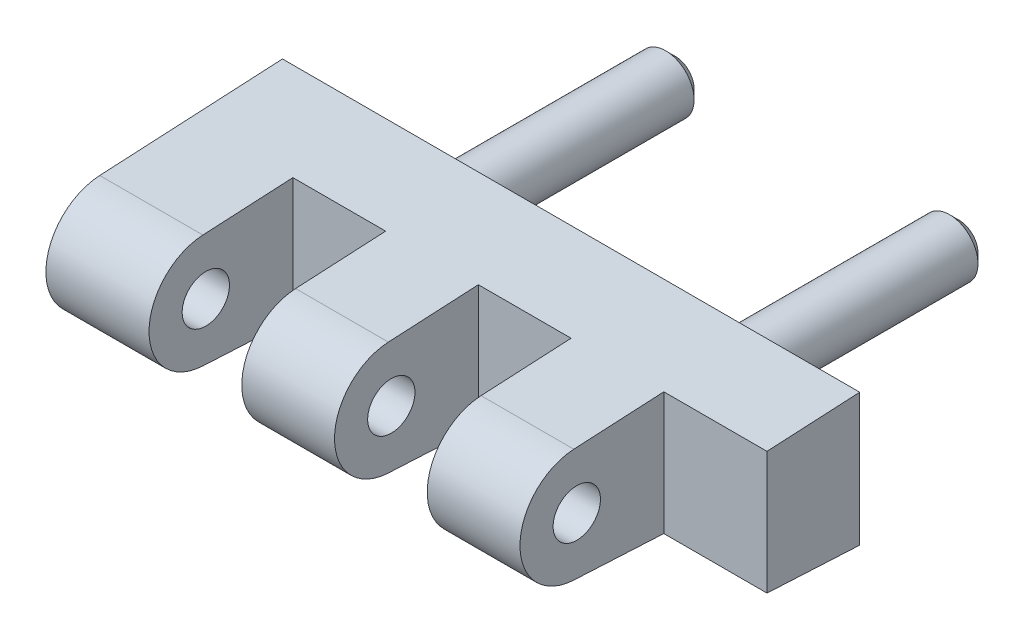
ISO-10303-21;
HEADER;
FILE_DESCRIPTION(('STEP AP214'),'2;1');
FILE_NAME('part.step','',(''),(''),'','','');
FILE_SCHEMA(('AUTOMOTIVE_DESIGN { 1 0 10303 214 1 1 1 1 }'));
ENDSEC;
DATA;
#1=APPLICATION_CONTEXT('core data for automotive mechanical design processes');
#2=APPLICATION_PROTOCOL_DEFINITION('international standard','automotive_design',2000,#1);
#3=PRODUCT_CONTEXT('',#1,'mechanical');
#4=PRODUCT('Part','Part','',(#3));
#5=PRODUCT_RELATED_PRODUCT_CATEGORY('part','',(#4));
#6=PRODUCT_DEFINITION_FORMATION('','',#4);
#7=PRODUCT_DEFINITION_CONTEXT('part definition',#1,'design');
#8=PRODUCT_DEFINITION('design','',#6,#7);
#9=PRODUCT_DEFINITION_SHAPE('','',#8);
#10=(LENGTH_UNIT() NAMED_UNIT(*) SI_UNIT(.MILLI.,.METRE.));
#11=(NAMED_UNIT(*) PLANE_ANGLE_UNIT() SI_UNIT($,.RADIAN.));
#12=(NAMED_UNIT(*) SI_UNIT($,.STERADIAN.) SOLID_ANGLE_UNIT());
#13=UNCERTAINTY_MEASURE_WITH_UNIT(LENGTH_MEASURE(1.E-05),#10,'distance_accuracy_value','');
#14=(GEOMETRIC_REPRESENTATION_CONTEXT(3) GLOBAL_UNCERTAINTY_ASSIGNED_CONTEXT((#13)) GLOBAL_UNIT_ASSIGNED_CONTEXT((#10,
#11,#12)) REPRESENTATION_CONTEXT('',''));
#15=CARTESIAN_POINT('',(0.,0.,0.));
#16=DIRECTION('',(0.,0.,1.));
#17=DIRECTION('',(1.,0.,0.));
#18=AXIS2_PLACEMENT_3D('',#15,#16,#17);
#19=CARTESIAN_POINT('',(22.75,0.,9.5));
#20=DIRECTION('',(-1.,0.,0.));
#21=DIRECTION('',(0.,-1.,0.));
#22=AXIS2_PLACEMENT_3D('',#19,#20,#21);
#23=CYLINDRICAL_SURFACE('',#22,3.);
#24=DIRECTION('',(-1.,0.,0.));
#25=VECTOR('',#24,1.);
#26=CARTESIAN_POINT('',(22.75,-2.99592082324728,9.65639188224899));
#27=LINE('',#26,#25);
#28=CARTESIAN_POINT('',(-2.3,-2.99592082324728,9.65639188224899));
#29=VERTEX_POINT('',#28);
#30=CARTESIAN_POINT('',(-7.75,-2.99592082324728,9.65639188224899));
#31=VERTEX_POINT('',#30);
#32=EDGE_CURVE('E157',#29,#31,#27,.T.);
#33=ORIENTED_EDGE('',*,*,#32,.F.);
#34=CARTESIAN_POINT('',(-2.3,0.,9.5));
#35=DIRECTION('',(-1.,0.,0.));
#36=DIRECTION('',(0.,0.,1.));
#37=AXIS2_PLACEMENT_3D('',#34,#35,#36);
#38=CIRCLE('',#37,3.);
#39=CARTESIAN_POINT('',(-2.3,2.99592082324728,9.65639188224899));
#40=VERTEX_POINT('',#39);
#41=EDGE_CURVE('E200',#29,#40,#38,.T.);
#42=ORIENTED_EDGE('',*,*,#41,.T.);
#43=DIRECTION('',(-1.,0.,0.));
#44=VECTOR('',#43,1.);
#45=CARTESIAN_POINT('',(22.75,2.99592082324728,9.65639188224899));
#46=LINE('',#45,#44);
#47=CARTESIAN_POINT('',(-7.75,2.99592082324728,9.65639188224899));
#48=VERTEX_POINT('',#47);
#49=EDGE_CURVE('E170',#40,#48,#46,.T.);
#50=ORIENTED_EDGE('',*,*,#49,.T.);
#51=CARTESIAN_POINT('',(-7.75,0.,9.5));
#52=DIRECTION('',(1.,0.,0.));
#53=DIRECTION('',(0.,1.,0.));
#54=AXIS2_PLACEMENT_3D('',#51,#52,#53);
#55=CIRCLE('',#54,3.);
#56=EDGE_CURVE('E152',#48,#31,#55,.T.);
#57=ORIENTED_EDGE('',*,*,#56,.T.);
#58=EDGE_LOOP('',(#33,#42,#50,#57));
#59=FACE_BOUND('',#58,.T.);
#60=ADVANCED_FACE('F14',(#59),#23,.T.);
#61=CARTESIAN_POINT('',(7.5,2.99592082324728,9.65639188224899));
#62=VERTEX_POINT('',#61);
#63=CARTESIAN_POINT('',(2.6,2.99592082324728,9.65639188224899));
#64=VERTEX_POINT('',#63);
#65=EDGE_CURVE('E172',#62,#64,#46,.T.);
#66=ORIENTED_EDGE('',*,*,#65,.T.);
#67=CARTESIAN_POINT('',(2.6,0.,9.5));
#68=DIRECTION('',(1.,0.,0.));
#69=DIRECTION('',(0.,0.,-1.));
#70=AXIS2_PLACEMENT_3D('',#67,#68,#69);
#71=CIRCLE('',#70,3.);
#72=CARTESIAN_POINT('',(2.6,-2.99592082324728,9.65639188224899));
#73=VERTEX_POINT('',#72);
#74=EDGE_CURVE('E195',#64,#73,#71,.T.);
#75=ORIENTED_EDGE('',*,*,#74,.T.);
#76=CARTESIAN_POINT('',(7.5,-2.99592082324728,9.65639188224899));
#77=VERTEX_POINT('',#76);
#78=EDGE_CURVE('E168',#77,#73,#27,.T.);
#79=ORIENTED_EDGE('',*,*,#78,.F.);
#80=CARTESIAN_POINT('',(7.5,0.,9.5));
#81=DIRECTION('',(-1.,0.,0.));
#82=DIRECTION('',(0.,0.,1.));
#83=AXIS2_PLACEMENT_3D('',#80,#81,#82);
#84=CIRCLE('',#83,3.);
#85=EDGE_CURVE('E190',#77,#62,#84,.T.);
#86=ORIENTED_EDGE('',*,*,#85,.T.);
#87=EDGE_LOOP('',(#66,#75,#79,#86));
#88=FACE_BOUND('',#87,.T.);
#89=ADVANCED_FACE('F230',(#88),#23,.T.);
#90=CARTESIAN_POINT('',(22.75,0.,9.5));
#91=DIRECTION('',(-1.,0.,0.));
#92=DIRECTION('',(0.,-1.,0.));
#93=AXIS2_PLACEMENT_3D('',#90,#91,#92);
#94=CYLINDRICAL_SURFACE('',#93,1.25);
#95=CARTESIAN_POINT('',(-2.3,0.,9.5));
#96=DIRECTION('',(-1.,0.,0.));
#97=DIRECTION('',(0.,0.,1.));
#98=AXIS2_PLACEMENT_3D('',#95,#96,#97);
#99=CIRCLE('',#98,1.25);
#100=CARTESIAN_POINT('',(-2.3,0.,10.75));
#101=VERTEX_POINT('',#100);
#102=EDGE_CURVE('E197',#101,#101,#99,.T.);
#103=ORIENTED_EDGE('',*,*,#102,.F.);
#104=EDGE_LOOP('',(#103));
#105=FACE_BOUND('',#104,.T.);
#106=CARTESIAN_POINT('',(-7.75,0.,9.5));
#107=DIRECTION('',(1.,0.,0.));
#108=DIRECTION('',(0.,1.,0.));
#109=AXIS2_PLACEMENT_3D('',#106,#107,#108);
#110=CIRCLE('',#109,1.25);
#111=CARTESIAN_POINT('',(-7.75,1.25,9.5));
#112=VERTEX_POINT('',#111);
#113=EDGE_CURVE('E140',#112,#112,#110,.T.);
#114=ORIENTED_EDGE('',*,*,#113,.F.);
#115=EDGE_LOOP('',(#114));
#116=FACE_BOUND('',#115,.T.);
#117=ADVANCED_FACE('F238',(#105,#116),#94,.F.);
#118=CARTESIAN_POINT('',(22.75,0.,9.5));
#119=DIRECTION('',(1.,0.,0.));
#120=DIRECTION('',(0.,1.,0.));
#121=AXIS2_PLACEMENT_3D('',#118,#119,#120);
#122=PLANE('',#121);
#123=DIRECTION('',(0.,1.,0.));
#124=VECTOR('',#123,1.);
#125=CARTESIAN_POINT('',(22.75,0.,4.9));
#126=LINE('',#125,#124);
#127=CARTESIAN_POINT('',(22.75,-3.24421212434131,4.9));
#128=VERTEX_POINT('',#127);
#129=CARTESIAN_POINT('',(22.75,3.24421212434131,4.9));
#130=VERTEX_POINT('',#129);
#131=EDGE_CURVE('E141',#128,#130,#126,.T.);
#132=ORIENTED_EDGE('',*,*,#131,.F.);
#133=DIRECTION('',(0.,-0.0521306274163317,-0.998640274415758));
#134=VECTOR('',#133,1.);
#135=CARTESIAN_POINT('',(22.75,-3.5,0.));
#136=LINE('',#135,#134);
#137=CARTESIAN_POINT('',(22.75,-3.5,0.));
#138=VERTEX_POINT('',#137);
#139=EDGE_CURVE('E139',#128,#138,#136,.T.);
#140=ORIENTED_EDGE('',*,*,#139,.T.);
#141=DIRECTION('',(0.,1.,0.));
#142=VECTOR('',#141,1.);
#143=CARTESIAN_POINT('',(22.75,-3.5,0.));
#144=LINE('',#143,#142);
#145=CARTESIAN_POINT('',(22.75,3.5,0.));
#146=VERTEX_POINT('',#145);
#147=EDGE_CURVE('E151',#138,#146,#144,.T.);
#148=ORIENTED_EDGE('',*,*,#147,.T.);
#149=DIRECTION('',(0.,-0.0521306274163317,0.998640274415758));
#150=VECTOR('',#149,1.);
#151=CARTESIAN_POINT('',(22.75,3.5,0.));
#152=LINE('',#151,#150);
#153=EDGE_CURVE('E154',#146,#130,#152,.T.);
#154=ORIENTED_EDGE('',*,*,#153,.T.);
#155=EDGE_LOOP('',(#132,#140,#148,#154));
#156=FACE_BOUND('',#155,.T.);
#157=ADVANCED_FACE('F339',(#156),#122,.T.);
#158=CARTESIAN_POINT('',(-7.75,0.,9.5));
#159=DIRECTION('',(1.,0.,0.));
#160=DIRECTION('',(0.,1.,0.));
#161=AXIS2_PLACEMENT_3D('',#158,#159,#160);
#162=PLANE('',#161);
#163=DIRECTION('',(0.,-0.0521306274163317,-0.998640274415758));
#164=VECTOR('',#163,1.);
#165=CARTESIAN_POINT('',(-7.75,-3.5,0.));
#166=LINE('',#165,#164);
#167=CARTESIAN_POINT('',(-7.75,-3.5,0.));
#168=VERTEX_POINT('',#167);
#169=EDGE_CURVE('E144',#31,#168,#166,.T.);
#170=ORIENTED_EDGE('',*,*,#169,.F.);
#171=ORIENTED_EDGE('',*,*,#56,.F.);
#172=DIRECTION('',(0.,-0.0521306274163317,0.998640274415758));
#173=VECTOR('',#172,1.);
#174=CARTESIAN_POINT('',(-7.75,3.5,0.));
#175=LINE('',#174,#173);
#176=CARTESIAN_POINT('',(-7.75,3.5,0.));
#177=VERTEX_POINT('',#176);
#178=EDGE_CURVE('E162',#177,#48,#175,.T.);
#179=ORIENTED_EDGE('',*,*,#178,.F.);
#180=DIRECTION('',(0.,1.,0.));
#181=VECTOR('',#180,1.);
#182=CARTESIAN_POINT('',(-7.75,-3.5,0.));
#183=LINE('',#182,#181);
#184=EDGE_CURVE('E160',#168,#177,#183,.T.);
#185=ORIENTED_EDGE('',*,*,#184,.F.);
#186=EDGE_LOOP('',(#170,#171,#179,#185));
#187=FACE_BOUND('',#186,.T.);
#188=ORIENTED_EDGE('',*,*,#113,.T.);
#189=EDGE_LOOP('',(#188));
#190=FACE_BOUND('',#189,.T.);
#191=ADVANCED_FACE('F341',(#187,#190),#162,.F.);
#192=CARTESIAN_POINT('',(22.75,-3.5,0.));
#193=DIRECTION('',(0.,0.998640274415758,-0.0521306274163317));
#194=DIRECTION('',(0.,0.0521306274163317,0.998640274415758));
#195=AXIS2_PLACEMENT_3D('',#192,#193,#194);
#196=PLANE('',#195);
#197=DIRECTION('',(-1.,0.,0.));
#198=VECTOR('',#197,1.);
#199=CARTESIAN_POINT('',(22.75,-3.24421212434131,4.9));
#200=LINE('',#199,#198);
#201=CARTESIAN_POINT('',(2.6,-3.24421212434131,4.9));
#202=VERTEX_POINT('',#201);
#203=CARTESIAN_POINT('',(-2.3,-3.24421212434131,4.9));
#204=VERTEX_POINT('',#203);
#205=EDGE_CURVE('E146',#202,#204,#200,.T.);
#206=ORIENTED_EDGE('',*,*,#205,.T.);
#207=DIRECTION('',(0.,0.0521306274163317,0.998640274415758));
#208=VECTOR('',#207,1.);
#209=CARTESIAN_POINT('',(-2.3,-3.5,0.));
#210=LINE('',#209,#208);
#211=EDGE_CURVE('E280',#204,#29,#210,.T.);
#212=ORIENTED_EDGE('',*,*,#211,.T.);
#213=ORIENTED_EDGE('',*,*,#32,.T.);
#214=ORIENTED_EDGE('',*,*,#169,.T.);
#215=DIRECTION('',(-1.,0.,0.));
#216=VECTOR('',#215,1.);
#217=CARTESIAN_POINT('',(22.75,-3.5,0.));
#218=LINE('',#217,#216);
#219=EDGE_CURVE('E177',#138,#168,#218,.T.);
#220=ORIENTED_EDGE('',*,*,#219,.F.);
#221=ORIENTED_EDGE('',*,*,#139,.F.);
#222=DIRECTION('',(-1.,0.,0.));
#223=VECTOR('',#222,1.);
#224=CARTESIAN_POINT('',(22.75,-3.24421212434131,4.9));
#225=LINE('',#224,#223);
#226=CARTESIAN_POINT('',(17.3,-3.24421212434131,4.9));
#227=VERTEX_POINT('',#226);
#228=EDGE_CURVE('E128',#128,#227,#225,.T.);
#229=ORIENTED_EDGE('',*,*,#228,.T.);
#230=DIRECTION('',(0.,0.0521306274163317,0.998640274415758));
#231=VECTOR('',#230,1.);
#232=CARTESIAN_POINT('',(17.3,-3.5,0.));
#233=LINE('',#232,#231);
#234=CARTESIAN_POINT('',(17.3,-2.99592082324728,9.65639188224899));
#235=VERTEX_POINT('',#234);
#236=EDGE_CURVE('E115',#227,#235,#233,.T.);
#237=ORIENTED_EDGE('',*,*,#236,.T.);
#238=CARTESIAN_POINT('',(12.4,-2.99592082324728,9.65639188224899));
#239=VERTEX_POINT('',#238);
#240=EDGE_CURVE('E169',#235,#239,#27,.T.);
#241=ORIENTED_EDGE('',*,*,#240,.T.);
#242=DIRECTION('',(0.,-0.0521306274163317,-0.998640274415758));
#243=VECTOR('',#242,1.);
#244=CARTESIAN_POINT('',(12.4,-3.5,0.));
#245=LINE('',#244,#243);
#246=CARTESIAN_POINT('',(12.4,-3.24421212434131,4.9));
#247=VERTEX_POINT('',#246);
#248=EDGE_CURVE('E191',#239,#247,#245,.T.);
#249=ORIENTED_EDGE('',*,*,#248,.T.);
#250=DIRECTION('',(-1.,0.,0.));
#251=VECTOR('',#250,1.);
#252=CARTESIAN_POINT('',(22.75,-3.24421212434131,4.9));
#253=LINE('',#252,#251);
#254=CARTESIAN_POINT('',(7.5,-3.24421212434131,4.9));
#255=VERTEX_POINT('',#254);
#256=EDGE_CURVE('E283',#247,#255,#253,.T.);
#257=ORIENTED_EDGE('',*,*,#256,.T.);
#258=DIRECTION('',(0.,0.0521306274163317,0.998640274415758));
#259=VECTOR('',#258,1.);
#260=CARTESIAN_POINT('',(7.5,-3.5,0.));
#261=LINE('',#260,#259);
#262=EDGE_CURVE('E196',#255,#77,#261,.T.);
#263=ORIENTED_EDGE('',*,*,#262,.T.);
#264=ORIENTED_EDGE('',*,*,#78,.T.);
#265=DIRECTION('',(0.,-0.0521306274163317,-0.998640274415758));
#266=VECTOR('',#265,1.);
#267=CARTESIAN_POINT('',(2.6,-3.5,0.));
#268=LINE('',#267,#266);
#269=EDGE_CURVE('E37',#73,#202,#268,.T.);
#270=ORIENTED_EDGE('',*,*,#269,.T.);
#271=EDGE_LOOP('',(#206,#212,#213,#214,#220,#221,#229,#237,#241,#249,#257,#263,#264,#270));
#272=FACE_BOUND('',#271,.T.);
#273=ADVANCED_FACE('F137',(#272),#196,.F.);
#274=CARTESIAN_POINT('',(22.75,-3.5,0.));
#275=DIRECTION('',(0.,0.,1.));
#276=DIRECTION('',(0.,-1.,0.));
#277=AXIS2_PLACEMENT_3D('',#274,#275,#276);
#278=PLANE('',#277);
#279=CARTESIAN_POINT('',(0.,0.,0.));
#280=DIRECTION('',(0.,0.,-1.));
#281=DIRECTION('',(-1.,0.,0.));
#282=AXIS2_PLACEMENT_3D('',#279,#280,#281);
#283=CIRCLE('',#282,1.5);
#284=CARTESIAN_POINT('',(-1.5,0.,0.));
#285=VERTEX_POINT('',#284);
#286=EDGE_CURVE('E133',#285,#285,#283,.T.);
#287=ORIENTED_EDGE('',*,*,#286,.F.);
#288=EDGE_LOOP('',(#287));
#289=FACE_BOUND('',#288,.T.);
#290=CARTESIAN_POINT('',(15.,0.,0.));
#291=DIRECTION('',(0.,0.,-1.));
#292=DIRECTION('',(-1.,0.,0.));
#293=AXIS2_PLACEMENT_3D('',#290,#291,#292);
#294=CIRCLE('',#293,1.5);
#295=CARTESIAN_POINT('',(13.5,0.,0.));
#296=VERTEX_POINT('',#295);
#297=EDGE_CURVE('E516',#296,#296,#294,.T.);
#298=ORIENTED_EDGE('',*,*,#297,.F.);
#299=EDGE_LOOP('',(#298));
#300=FACE_BOUND('',#299,.T.);
#301=ORIENTED_EDGE('',*,*,#184,.T.);
#302=DIRECTION('',(-1.,0.,0.));
#303=VECTOR('',#302,1.);
#304=CARTESIAN_POINT('',(22.75,3.5,0.));
#305=LINE('',#304,#303);
#306=EDGE_CURVE('E174',#146,#177,#305,.T.);
#307=ORIENTED_EDGE('',*,*,#306,.F.);
#308=ORIENTED_EDGE('',*,*,#147,.F.);
#309=ORIENTED_EDGE('',*,*,#219,.T.);
#310=EDGE_LOOP('',(#301,#307,#308,#309));
#311=FACE_BOUND('',#310,.T.);
#312=ADVANCED_FACE('F253',(#289,#300,#311),#278,.F.);
#313=CARTESIAN_POINT('',(22.75,3.5,0.));
#314=DIRECTION('',(0.,-0.998640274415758,-0.0521306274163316));
#315=DIRECTION('',(0.,0.0521306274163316,-0.998640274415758));
#316=AXIS2_PLACEMENT_3D('',#313,#314,#315);
#317=PLANE('',#316);
#318=ORIENTED_EDGE('',*,*,#49,.F.);
#319=DIRECTION('',(0.,0.0521306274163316,-0.998640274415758));
#320=VECTOR('',#319,1.);
#321=CARTESIAN_POINT('',(-2.3,3.5,0.));
#322=LINE('',#321,#320);
#323=CARTESIAN_POINT('',(-2.3,3.24421212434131,4.9));
#324=VERTEX_POINT('',#323);
#325=EDGE_CURVE('E278',#40,#324,#322,.T.);
#326=ORIENTED_EDGE('',*,*,#325,.T.);
#327=DIRECTION('',(1.,0.,0.));
#328=VECTOR('',#327,1.);
#329=CARTESIAN_POINT('',(22.75,3.24421212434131,4.9));
#330=LINE('',#329,#328);
#331=CARTESIAN_POINT('',(2.6,3.24421212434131,4.9));
#332=VERTEX_POINT('',#331);
#333=EDGE_CURVE('E205',#324,#332,#330,.T.);
#334=ORIENTED_EDGE('',*,*,#333,.T.);
#335=DIRECTION('',(0.,-0.0521306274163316,0.998640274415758));
#336=VECTOR('',#335,1.);
#337=CARTESIAN_POINT('',(2.6,3.5,0.));
#338=LINE('',#337,#336);
#339=EDGE_CURVE('E268',#332,#64,#338,.T.);
#340=ORIENTED_EDGE('',*,*,#339,.T.);
#341=ORIENTED_EDGE('',*,*,#65,.F.);
#342=DIRECTION('',(0.,0.0521306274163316,-0.998640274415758));
#343=VECTOR('',#342,1.);
#344=CARTESIAN_POINT('',(7.5,3.5,0.));
#345=LINE('',#344,#343);
#346=CARTESIAN_POINT('',(7.5,3.24421212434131,4.9));
#347=VERTEX_POINT('',#346);
#348=EDGE_CURVE('E267',#62,#347,#345,.T.);
#349=ORIENTED_EDGE('',*,*,#348,.T.);
#350=DIRECTION('',(1.,0.,0.));
#351=VECTOR('',#350,1.);
#352=CARTESIAN_POINT('',(22.75,3.24421212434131,4.9));
#353=LINE('',#352,#351);
#354=CARTESIAN_POINT('',(12.4,3.24421212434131,4.9));
#355=VERTEX_POINT('',#354);
#356=EDGE_CURVE('E202',#347,#355,#353,.T.);
#357=ORIENTED_EDGE('',*,*,#356,.T.);
#358=DIRECTION('',(0.,-0.0521306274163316,0.998640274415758));
#359=VECTOR('',#358,1.);
#360=CARTESIAN_POINT('',(12.4,3.5,0.));
#361=LINE('',#360,#359);
#362=CARTESIAN_POINT('',(12.4,2.99592082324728,9.65639188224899));
#363=VERTEX_POINT('',#362);
#364=EDGE_CURVE('E303',#355,#363,#361,.T.);
#365=ORIENTED_EDGE('',*,*,#364,.T.);
#366=CARTESIAN_POINT('',(17.3,2.99592082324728,9.65639188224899));
#367=VERTEX_POINT('',#366);
#368=EDGE_CURVE('E173',#367,#363,#46,.T.);
#369=ORIENTED_EDGE('',*,*,#368,.F.);
#370=DIRECTION('',(0.,0.0521306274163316,-0.998640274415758));
#371=VECTOR('',#370,1.);
#372=CARTESIAN_POINT('',(17.3,3.5,0.));
#373=LINE('',#372,#371);
#374=CARTESIAN_POINT('',(17.3,3.24421212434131,4.9));
#375=VERTEX_POINT('',#374);
#376=EDGE_CURVE('E29',#367,#375,#373,.T.);
#377=ORIENTED_EDGE('',*,*,#376,.T.);
#378=DIRECTION('',(1.,0.,0.));
#379=VECTOR('',#378,1.);
#380=CARTESIAN_POINT('',(22.75,3.24421212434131,4.9));
#381=LINE('',#380,#379);
#382=EDGE_CURVE('E131',#375,#130,#381,.T.);
#383=ORIENTED_EDGE('',*,*,#382,.T.);
#384=ORIENTED_EDGE('',*,*,#153,.F.);
#385=ORIENTED_EDGE('',*,*,#306,.T.);
#386=ORIENTED_EDGE('',*,*,#178,.T.);
#387=EDGE_LOOP('',(#318,#326,#334,#340,#341,#349,#357,#365,#369,#377,#383,#384,#385,#386));
#388=FACE_BOUND('',#387,.T.);
#389=ADVANCED_FACE('F244',(#388),#317,.F.);
#390=ORIENTED_EDGE('',*,*,#368,.T.);
#391=CARTESIAN_POINT('',(12.4,0.,9.5));
#392=DIRECTION('',(1.,0.,0.));
#393=DIRECTION('',(0.,0.,-1.));
#394=AXIS2_PLACEMENT_3D('',#391,#392,#393);
#395=CIRCLE('',#394,3.);
#396=EDGE_CURVE('E186',#363,#239,#395,.T.);
#397=ORIENTED_EDGE('',*,*,#396,.T.);
#398=ORIENTED_EDGE('',*,*,#240,.F.);
#399=CARTESIAN_POINT('',(17.3,0.,9.5));
#400=DIRECTION('',(-1.,0.,0.));
#401=DIRECTION('',(0.,0.,1.));
#402=AXIS2_PLACEMENT_3D('',#399,#400,#401);
#403=CIRCLE('',#402,3.);
#404=EDGE_CURVE('E119',#235,#367,#403,.T.);
#405=ORIENTED_EDGE('',*,*,#404,.T.);
#406=EDGE_LOOP('',(#390,#397,#398,#405));
#407=FACE_BOUND('',#406,.T.);
#408=ADVANCED_FACE('F233',(#407),#23,.T.);
#409=CARTESIAN_POINT('',(17.3,-5.,16.2892797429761));
#410=DIRECTION('',(-1.,0.,0.));
#411=DIRECTION('',(0.,0.,1.));
#412=AXIS2_PLACEMENT_3D('',#409,#410,#411);
#413=PLANE('',#412);
#414=CARTESIAN_POINT('',(17.3,0.,9.5));
#415=DIRECTION('',(-1.,0.,0.));
#416=DIRECTION('',(0.,0.,1.));
#417=AXIS2_PLACEMENT_3D('',#414,#415,#416);
#418=CIRCLE('',#417,1.25);
#419=CARTESIAN_POINT('',(17.3,0.,10.75));
#420=VERTEX_POINT('',#419);
#421=EDGE_CURVE('E180',#420,#420,#418,.T.);
#422=ORIENTED_EDGE('',*,*,#421,.T.);
#423=EDGE_LOOP('',(#422));
#424=FACE_BOUND('',#423,.T.);
#425=DIRECTION('',(0.,1.,0.));
#426=VECTOR('',#425,1.);
#427=CARTESIAN_POINT('',(17.3,-5.,4.9));
#428=LINE('',#427,#426);
#429=EDGE_CURVE('E118',#227,#375,#428,.T.);
#430=ORIENTED_EDGE('',*,*,#429,.T.);
#431=ORIENTED_EDGE('',*,*,#376,.F.);
#432=ORIENTED_EDGE('',*,*,#404,.F.);
#433=ORIENTED_EDGE('',*,*,#236,.F.);
#434=EDGE_LOOP('',(#430,#431,#432,#433));
#435=FACE_BOUND('',#434,.T.);
#436=ADVANCED_FACE('F117',(#424,#435),#413,.F.);
#437=CARTESIAN_POINT('',(17.3,-5.,4.9));
#438=DIRECTION('',(0.,0.,-1.));
#439=DIRECTION('',(-1.,0.,0.));
#440=AXIS2_PLACEMENT_3D('',#437,#438,#439);
#441=PLANE('',#440);
#442=ORIENTED_EDGE('',*,*,#131,.T.);
#443=ORIENTED_EDGE('',*,*,#382,.F.);
#444=ORIENTED_EDGE('',*,*,#429,.F.);
#445=ORIENTED_EDGE('',*,*,#228,.F.);
#446=EDGE_LOOP('',(#442,#443,#444,#445));
#447=FACE_BOUND('',#446,.T.);
#448=ADVANCED_FACE('F127',(#447),#441,.F.);
#449=CARTESIAN_POINT('',(7.5,-5.,4.9));
#450=DIRECTION('',(-1.,0.,0.));
#451=DIRECTION('',(0.,0.,1.));
#452=AXIS2_PLACEMENT_3D('',#449,#450,#451);
#453=PLANE('',#452);
#454=CARTESIAN_POINT('',(7.5,0.,9.5));
#455=DIRECTION('',(-1.,0.,0.));
#456=DIRECTION('',(0.,0.,1.));
#457=AXIS2_PLACEMENT_3D('',#454,#455,#456);
#458=CIRCLE('',#457,1.25);
#459=CARTESIAN_POINT('',(7.5,0.,10.75));
#460=VERTEX_POINT('',#459);
#461=EDGE_CURVE('E187',#460,#460,#458,.T.);
#462=ORIENTED_EDGE('',*,*,#461,.T.);
#463=EDGE_LOOP('',(#462));
#464=FACE_BOUND('',#463,.T.);
#465=DIRECTION('',(0.,1.,0.));
#466=VECTOR('',#465,1.);
#467=CARTESIAN_POINT('',(7.5,-5.,4.9));
#468=LINE('',#467,#466);
#469=EDGE_CURVE('E291',#255,#347,#468,.T.);
#470=ORIENTED_EDGE('',*,*,#469,.T.);
#471=ORIENTED_EDGE('',*,*,#348,.F.);
#472=ORIENTED_EDGE('',*,*,#85,.F.);
#473=ORIENTED_EDGE('',*,*,#262,.F.);
#474=EDGE_LOOP('',(#470,#471,#472,#473));
#475=FACE_BOUND('',#474,.T.);
#476=ADVANCED_FACE('F316',(#464,#475),#453,.F.);
#477=CARTESIAN_POINT('',(12.4,-5.,16.2892797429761));
#478=DIRECTION('',(1.,0.,0.));
#479=DIRECTION('',(0.,0.,-1.));
#480=AXIS2_PLACEMENT_3D('',#477,#478,#479);
#481=PLANE('',#480);
#482=CARTESIAN_POINT('',(12.4,0.,9.5));
#483=DIRECTION('',(1.,0.,0.));
#484=DIRECTION('',(0.,0.,-1.));
#485=AXIS2_PLACEMENT_3D('',#482,#483,#484);
#486=CIRCLE('',#485,1.25);
#487=CARTESIAN_POINT('',(12.4,0.,8.25));
#488=VERTEX_POINT('',#487);
#489=EDGE_CURVE('E124',#488,#488,#486,.T.);
#490=ORIENTED_EDGE('',*,*,#489,.T.);
#491=EDGE_LOOP('',(#490));
#492=FACE_BOUND('',#491,.T.);
#493=ORIENTED_EDGE('',*,*,#396,.F.);
#494=ORIENTED_EDGE('',*,*,#364,.F.);
#495=DIRECTION('',(0.,1.,0.));
#496=VECTOR('',#495,1.);
#497=CARTESIAN_POINT('',(12.4,-5.,4.9));
#498=LINE('',#497,#496);
#499=EDGE_CURVE('E132',#247,#355,#498,.T.);
#500=ORIENTED_EDGE('',*,*,#499,.F.);
#501=ORIENTED_EDGE('',*,*,#248,.F.);
#502=EDGE_LOOP('',(#493,#494,#500,#501));
#503=FACE_BOUND('',#502,.T.);
#504=ADVANCED_FACE('F313',(#492,#503),#481,.F.);
#505=CARTESIAN_POINT('',(12.4,-5.,4.9));
#506=DIRECTION('',(0.,0.,-1.));
#507=DIRECTION('',(-1.,0.,0.));
#508=AXIS2_PLACEMENT_3D('',#505,#506,#507);
#509=PLANE('',#508);
#510=ORIENTED_EDGE('',*,*,#499,.T.);
#511=ORIENTED_EDGE('',*,*,#356,.F.);
#512=ORIENTED_EDGE('',*,*,#469,.F.);
#513=ORIENTED_EDGE('',*,*,#256,.F.);
#514=EDGE_LOOP('',(#510,#511,#512,#513));
#515=FACE_BOUND('',#514,.T.);
#516=ADVANCED_FACE('F315',(#515),#509,.F.);
#517=CARTESIAN_POINT('',(2.6,0.,9.5));
#518=DIRECTION('',(1.,0.,0.));
#519=DIRECTION('',(0.,0.,-1.));
#520=AXIS2_PLACEMENT_3D('',#517,#518,#519);
#521=CIRCLE('',#520,1.25);
#522=CARTESIAN_POINT('',(2.6,0.,8.25));
#523=VERTEX_POINT('',#522);
#524=EDGE_CURVE('E192',#523,#523,#521,.T.);
#525=ORIENTED_EDGE('',*,*,#524,.F.);
#526=EDGE_LOOP('',(#525));
#527=FACE_BOUND('',#526,.T.);
#528=ORIENTED_EDGE('',*,*,#461,.F.);
#529=EDGE_LOOP('',(#528));
#530=FACE_BOUND('',#529,.T.);
#531=ADVANCED_FACE('F332',(#527,#530),#94,.F.);
#532=CARTESIAN_POINT('',(-2.3,-5.,4.9));
#533=DIRECTION('',(0.,0.,-1.));
#534=DIRECTION('',(-1.,0.,0.));
#535=AXIS2_PLACEMENT_3D('',#532,#533,#534);
#536=PLANE('',#535);
#537=DIRECTION('',(0.,1.,0.));
#538=VECTOR('',#537,1.);
#539=CARTESIAN_POINT('',(2.6,-5.,4.9));
#540=LINE('',#539,#538);
#541=EDGE_CURVE('E288',#202,#332,#540,.T.);
#542=ORIENTED_EDGE('',*,*,#541,.T.);
#543=ORIENTED_EDGE('',*,*,#333,.F.);
#544=DIRECTION('',(0.,1.,0.));
#545=VECTOR('',#544,1.);
#546=CARTESIAN_POINT('',(-2.3,-5.,4.9));
#547=LINE('',#546,#545);
#548=EDGE_CURVE('E183',#204,#324,#547,.T.);
#549=ORIENTED_EDGE('',*,*,#548,.F.);
#550=ORIENTED_EDGE('',*,*,#205,.F.);
#551=EDGE_LOOP('',(#542,#543,#549,#550));
#552=FACE_BOUND('',#551,.T.);
#553=ADVANCED_FACE('F287',(#552),#536,.F.);
#554=CARTESIAN_POINT('',(-2.3,-5.,23.2326815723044));
#555=DIRECTION('',(-1.,0.,0.));
#556=DIRECTION('',(0.,0.,1.));
#557=AXIS2_PLACEMENT_3D('',#554,#555,#556);
#558=PLANE('',#557);
#559=ORIENTED_EDGE('',*,*,#102,.T.);
#560=EDGE_LOOP('',(#559));
#561=FACE_BOUND('',#560,.T.);
#562=ORIENTED_EDGE('',*,*,#548,.T.);
#563=ORIENTED_EDGE('',*,*,#325,.F.);
#564=ORIENTED_EDGE('',*,*,#41,.F.);
#565=ORIENTED_EDGE('',*,*,#211,.F.);
#566=EDGE_LOOP('',(#562,#563,#564,#565));
#567=FACE_BOUND('',#566,.T.);
#568=ADVANCED_FACE('F367',(#561,#567),#558,.F.);
#569=CARTESIAN_POINT('',(2.6,-5.,16.2892797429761));
#570=DIRECTION('',(1.,0.,0.));
#571=DIRECTION('',(0.,0.,-1.));
#572=AXIS2_PLACEMENT_3D('',#569,#570,#571);
#573=PLANE('',#572);
#574=ORIENTED_EDGE('',*,*,#524,.T.);
#575=EDGE_LOOP('',(#574));
#576=FACE_BOUND('',#575,.T.);
#577=ORIENTED_EDGE('',*,*,#74,.F.);
#578=ORIENTED_EDGE('',*,*,#339,.F.);
#579=ORIENTED_EDGE('',*,*,#541,.F.);
#580=ORIENTED_EDGE('',*,*,#269,.F.);
#581=EDGE_LOOP('',(#577,#578,#579,#580));
#582=FACE_BOUND('',#581,.T.);
#583=ADVANCED_FACE('F290',(#576,#582),#573,.F.);
#584=ORIENTED_EDGE('',*,*,#489,.F.);
#585=EDGE_LOOP('',(#584));
#586=FACE_BOUND('',#585,.T.);
#587=ORIENTED_EDGE('',*,*,#421,.F.);
#588=EDGE_LOOP('',(#587));
#589=FACE_BOUND('',#588,.T.);
#590=ADVANCED_FACE('F334',(#586,#589),#94,.F.);
#591=CARTESIAN_POINT('',(0.,0.,-13.));
#592=DIRECTION('',(0.,0.,1.));
#593=DIRECTION('',(1.,0.,0.));
#594=AXIS2_PLACEMENT_3D('',#591,#592,#593);
#595=CYLINDRICAL_SURFACE('',#594,1.5);
#596=CARTESIAN_POINT('',(0.,0.,-12.5));
#597=DIRECTION('',(0.,0.,-1.));
#598=DIRECTION('',(-1.,0.,0.));
#599=AXIS2_PLACEMENT_3D('',#596,#597,#598);
#600=CIRCLE('',#599,1.5);
#601=CARTESIAN_POINT('',(-1.5,0.,-12.5));
#602=VERTEX_POINT('',#601);
#603=EDGE_CURVE('E9',#602,#602,#600,.F.);
#604=ORIENTED_EDGE('',*,*,#603,.T.);
#605=EDGE_LOOP('',(#604));
#606=FACE_BOUND('',#605,.T.);
#607=ORIENTED_EDGE('',*,*,#286,.T.);
#608=EDGE_LOOP('',(#607));
#609=FACE_BOUND('',#608,.T.);
#610=ADVANCED_FACE('F337',(#606,#609),#595,.T.);
#611=CARTESIAN_POINT('',(0.,0.,-13.));
#612=DIRECTION('',(0.,0.,-1.));
#613=DIRECTION('',(-1.,0.,0.));
#614=AXIS2_PLACEMENT_3D('',#611,#612,#613);
#615=PLANE('',#614);
#616=CARTESIAN_POINT('',(0.,0.,-13.));
#617=DIRECTION('',(0.,0.,-1.));
#618=DIRECTION('',(-1.,0.,0.));
#619=AXIS2_PLACEMENT_3D('',#616,#617,#618);
#620=CIRCLE('',#619,1.);
#621=CARTESIAN_POINT('',(-1.,0.,-13.));
#622=VERTEX_POINT('',#621);
#623=EDGE_CURVE('E22',#622,#622,#620,.T.);
#624=ORIENTED_EDGE('',*,*,#623,.T.);
#625=EDGE_LOOP('',(#624));
#626=FACE_BOUND('',#625,.T.);
#627=ADVANCED_FACE('F216',(#626),#615,.T.);
#628=CARTESIAN_POINT('',(15.,0.,-13.));
#629=DIRECTION('',(0.,0.,1.));
#630=DIRECTION('',(1.,0.,0.));
#631=AXIS2_PLACEMENT_3D('',#628,#629,#630);
#632=CYLINDRICAL_SURFACE('',#631,1.5);
#633=CARTESIAN_POINT('',(15.,0.,-12.5));
#634=DIRECTION('',(0.,0.,-1.));
#635=DIRECTION('',(-1.,0.,0.));
#636=AXIS2_PLACEMENT_3D('',#633,#634,#635);
#637=CIRCLE('',#636,1.5);
#638=CARTESIAN_POINT('',(13.5,0.,-12.5));
#639=VERTEX_POINT('',#638);
#640=EDGE_CURVE('E211',#639,#639,#637,.F.);
#641=ORIENTED_EDGE('',*,*,#640,.T.);
#642=EDGE_LOOP('',(#641));
#643=FACE_BOUND('',#642,.T.);
#644=ORIENTED_EDGE('',*,*,#297,.T.);
#645=EDGE_LOOP('',(#644));
#646=FACE_BOUND('',#645,.T.);
#647=ADVANCED_FACE('F389',(#643,#646),#632,.T.);
#648=CARTESIAN_POINT('',(15.,0.,-13.));
#649=DIRECTION('',(0.,0.,-1.));
#650=DIRECTION('',(-1.,0.,0.));
#651=AXIS2_PLACEMENT_3D('',#648,#649,#650);
#652=PLANE('',#651);
#653=CARTESIAN_POINT('',(15.,0.,-13.));
#654=DIRECTION('',(0.,0.,-1.));
#655=DIRECTION('',(-1.,0.,0.));
#656=AXIS2_PLACEMENT_3D('',#653,#654,#655);
#657=CIRCLE('',#656,1.);
#658=CARTESIAN_POINT('',(14.,0.,-13.));
#659=VERTEX_POINT('',#658);
#660=EDGE_CURVE('E208',#659,#659,#657,.T.);
#661=ORIENTED_EDGE('',*,*,#660,.T.);
#662=EDGE_LOOP('',(#661));
#663=FACE_BOUND('',#662,.T.);
#664=ADVANCED_FACE('F226',(#663),#652,.T.);
#665=CARTESIAN_POINT('',(15.,0.,-13.));
#666=DIRECTION('',(0.,0.,1.));
#667=DIRECTION('',(1.,0.,0.));
#668=AXIS2_PLACEMENT_3D('',#665,#666,#667);
#669=CONICAL_SURFACE('',#668,1.,0.785398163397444);
#670=ORIENTED_EDGE('',*,*,#640,.F.);
#671=EDGE_LOOP('',(#670));
#672=FACE_BOUND('',#671,.T.);
#673=ORIENTED_EDGE('',*,*,#660,.F.);
#674=EDGE_LOOP('',(#673));
#675=FACE_BOUND('',#674,.T.);
#676=ADVANCED_FACE('F219',(#672,#675),#669,.T.);
#677=CARTESIAN_POINT('',(0.,0.,-13.));
#678=DIRECTION('',(0.,0.,1.));
#679=DIRECTION('',(1.,0.,0.));
#680=AXIS2_PLACEMENT_3D('',#677,#678,#679);
#681=CONICAL_SURFACE('',#680,1.,0.785398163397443);
#682=ORIENTED_EDGE('',*,*,#603,.F.);
#683=EDGE_LOOP('',(#682));
#684=FACE_BOUND('',#683,.T.);
#685=ORIENTED_EDGE('',*,*,#623,.F.);
#686=EDGE_LOOP('',(#685));
#687=FACE_BOUND('',#686,.T.);
#688=ADVANCED_FACE('F16',(#684,#687),#681,.T.);
#689=CLOSED_SHELL('',(#60,#89,#117,#157,#191,#273,#312,#389,#408,#436,#448,#476,#504,#516,#531,
#553,#568,#583,#590,#610,#627,#647,#664,#676,#688));
#690=MANIFOLD_SOLID_BREP('B1',#689);
#691=ADVANCED_BREP_SHAPE_REPRESENTATION('',(#18,#690),#14);
#692=SHAPE_DEFINITION_REPRESENTATION(#9,#691);
ENDSEC;
END-ISO-10303-21;
